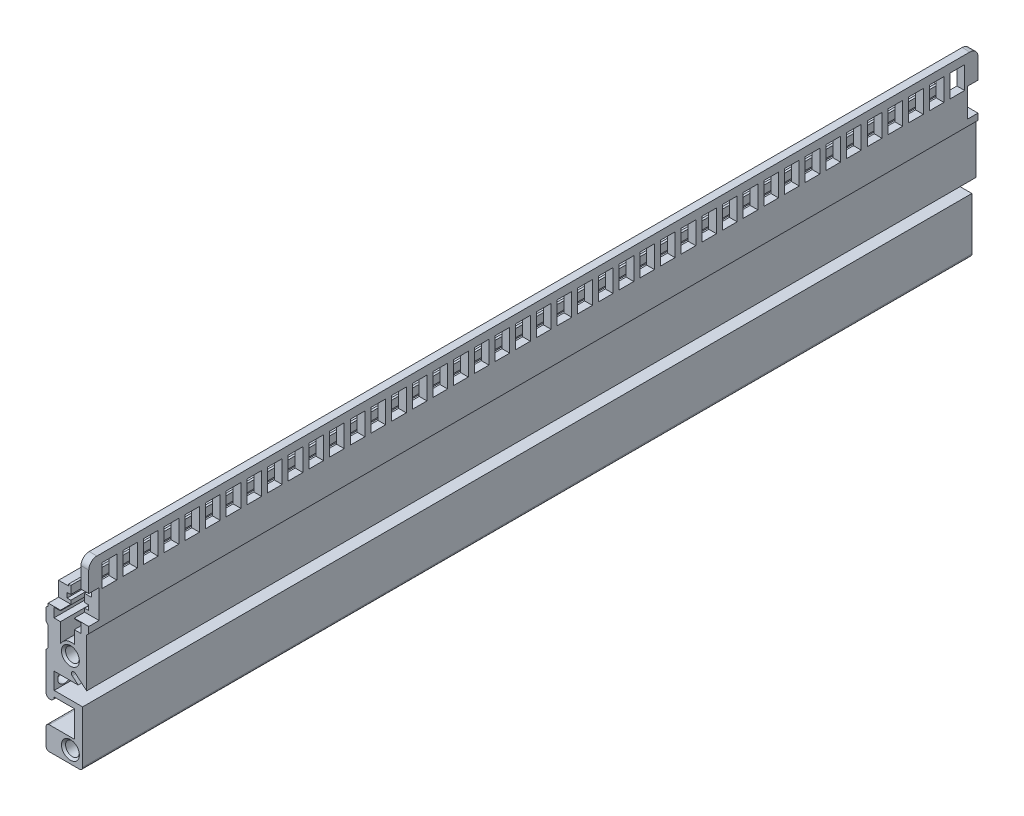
from build123d import *

# Parameters (mm, degrees)
SKETCH_1_R          = 1.7
EXTRUDE_1_DEPTH     = 218.44
FILLET_1_R          = 2
SKETCH_2_W          = 3.6
SKETCH_2_H          = 5.5
CUT_EXTRUDE_1_DEPTH = 1.9
SKETCH_3_W          = 2.54
SKETCH_3_H          = 7
CUT_EXTRUDE_2_DEPTH = 220.898348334
SKETCH_4_R          = 1.65
CUT_EXTRUDE_3_DEPTH = 2
CHAMFER_1_SIZE      = 0.5
CHAMFER_2_SIZE      = 0.5


with BuildPart() as part:
    # Sketch 1 → Extrude 1 (new body)
    with BuildSketch(Plane.XY):
        with BuildLine():
            Line((2.6, 12.5), (2.6, 22.5))
            Line((2.6, 22.5), (4.5, 22.5))
            Line((4.5, 22.5), (4.5, 6.95))
            Line((4.5, 6.95), (4, 6.45))
            Line((4, 6.45), (4, -5.445811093))
            Line((4, -5.445811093), (1.222426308, -3.115150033))
            ThreePointArc((1.222426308, -3.115150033), (0.377127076, -3.189104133), (0.451081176, -4.034403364))
            Line((0.451081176, -4.034403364), (1.899772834, -5.25))
            Line((1.899772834, -5.25), (-4, -5.25))
            Line((-4, -5.25), (-4, -9.35))
            Line((-4, -9.35), (3, -9.35))
            Line((3, -9.35), (3, -22.2))
            ThreePointArc((3, -22.2), (2.765685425, -22.765685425), (2.2, -23))
            Line((2.2, -23), (-5.2, -23))
            ThreePointArc((-5.2, -23), (-5.765685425, -22.765685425), (-6, -22.2))
            Line((-6, -22.2), (-6, -18.05))
            ThreePointArc((-6, -18.05), (-5.765685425, -17.484314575), (-5.2, -17.25))
            Line((-5.2, -17.25), (1, -17.25))
            Line((1, -17.25), (1, -10.75))
            Line((1, -10.75), (-4, -10.75))
            ThreePointArc((-4, -10.75), (-5, -11.75), (-6, -10.75))
            Line((-6, -10.75), (-6, -1.6))
            Line((-6, -1.6), (-5.550132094, -1.100195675))
            Line((-5.550132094, -1.100195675), (-5.549867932, 3.899804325))
            Line((-5.549867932, 3.899804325), (-6, 4.4))
            Line((-6, 4.4), (-6, 7.4))
            Line((-6, 7.4), (-5.7, 7.7))
            Line((-5.7, 7.7), (-5.45, 7.7))
            Line((-5.45, 7.7), (-5.45, 12.1))
            Line((-5.45, 12.1), (-3, 12.1))
            Line((-3, 12.1), (-3, 12.5))
            Line((-3, 12.5), (-2.45, 12.5))
            Line((-2.45, 12.5), (-2.45, 10.55))
            Line((-2.45, 10.55), (-3.35, 10.55))
            Line((-3.35, 10.55), (-3.35, 9.35))
            Line((-3.35, 9.35), (-2.45, 9.35))
            Line((-2.45, 9.35), (-2.45, 8.35))
            Line((-2.45, 8.35), (-4.05, 8.35))
            Line((-4.05, 8.35), (-4.05, 6.05))
            Line((-4.05, 6.05), (-2.45, 6.05))
            Line((-2.45, 6.05), (-2.45, 1.307669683))
            ThreePointArc((-2.45, 1.307669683), (-1.033604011, 2.711523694), (0.95, 2.917190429))
            Line((0.95, 2.917190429), (0.95, 6.05))
            Line((0.95, 6.05), (2.55, 6.05))
            Line((2.55, 6.05), (2.55, 8.35))
            Line((2.55, 8.35), (0.95, 8.35))
            Line((0.95, 8.35), (0.95, 9.35))
            Line((0.95, 9.35), (1.85, 9.35))
            Line((1.85, 9.35), (1.85, 10.55))
            Line((1.85, 10.55), (0.95, 10.55))
            Line((0.95, 10.55), (0.95, 12.5))
            Line((0.95, 12.5), (2.6, 12.5))
        make_face()
        Circle(SKETCH_1_R, mode=Mode.SUBTRACT)
        with Locations((0, -20)):
            Circle(SKETCH_1_R, mode=Mode.SUBTRACT)
    extrude(amount=-EXTRUDE_1_DEPTH)

    # Fillet 1
    fillet_1_edges = [part.edges().sort_by_distance(p)[0] for p in [
        (3.55, 22.5, -218.44),
        (3.55, 22.5, 0),
    ]]
    fillet(fillet_1_edges, radius=FILLET_1_R)

    # Sketch 2 → Cut-Extrude 1 (cut)
    with BuildSketch(Plane(origin=(4.5, 0, 0), x_dir=(0, 0, -1), z_dir=(1, 0, 0))):
        with Locations((10.16, 17.7)):
            Rectangle(SKETCH_2_W, SKETCH_2_H)
        with Locations((5.08, 17.7)):
            Rectangle(SKETCH_2_W, SKETCH_2_H)
        with Locations((15.24, 17.7)):
            Rectangle(SKETCH_2_W, SKETCH_2_H)
        with Locations((20.32, 17.7)):
            Rectangle(SKETCH_2_W, SKETCH_2_H)
        with Locations((25.4, 17.7)):
            Rectangle(SKETCH_2_W, SKETCH_2_H)
        with Locations((30.48, 17.7)):
            Rectangle(SKETCH_2_W, SKETCH_2_H)
        with Locations((35.56, 17.7)):
            Rectangle(SKETCH_2_W, SKETCH_2_H)
        with Locations((40.64, 17.7)):
            Rectangle(SKETCH_2_W, SKETCH_2_H)
        with Locations((45.72, 17.7)):
            Rectangle(SKETCH_2_W, SKETCH_2_H)
        with Locations((50.8, 17.7)):
            Rectangle(SKETCH_2_W, SKETCH_2_H)
        with Locations((55.88, 17.7)):
            Rectangle(SKETCH_2_W, SKETCH_2_H)
        with Locations((60.96, 17.7)):
            Rectangle(SKETCH_2_W, SKETCH_2_H)
        with Locations((66.04, 17.7)):
            Rectangle(SKETCH_2_W, SKETCH_2_H)
        with Locations((71.12, 17.7)):
            Rectangle(SKETCH_2_W, SKETCH_2_H)
        with Locations((76.2, 17.7)):
            Rectangle(SKETCH_2_W, SKETCH_2_H)
        with Locations((81.28, 17.7)):
            Rectangle(SKETCH_2_W, SKETCH_2_H)
        with Locations((86.36, 17.7)):
            Rectangle(SKETCH_2_W, SKETCH_2_H)
        with Locations((91.44, 17.7)):
            Rectangle(SKETCH_2_W, SKETCH_2_H)
        with Locations((96.52, 17.7)):
            Rectangle(SKETCH_2_W, SKETCH_2_H)
        with Locations((101.6, 17.7)):
            Rectangle(SKETCH_2_W, SKETCH_2_H)
        with Locations((106.68, 17.7)):
            Rectangle(SKETCH_2_W, SKETCH_2_H)
        with Locations((111.76, 17.7)):
            Rectangle(SKETCH_2_W, SKETCH_2_H)
        with Locations((116.84, 17.7)):
            Rectangle(SKETCH_2_W, SKETCH_2_H)
        with Locations((121.92, 17.7)):
            Rectangle(SKETCH_2_W, SKETCH_2_H)
        with Locations((127, 17.7)):
            Rectangle(SKETCH_2_W, SKETCH_2_H)
        with Locations((132.08, 17.7)):
            Rectangle(SKETCH_2_W, SKETCH_2_H)
        with Locations((137.16, 17.7)):
            Rectangle(SKETCH_2_W, SKETCH_2_H)
        with Locations((142.24, 17.7)):
            Rectangle(SKETCH_2_W, SKETCH_2_H)
        with Locations((147.32, 17.7)):
            Rectangle(SKETCH_2_W, SKETCH_2_H)
        with Locations((152.4, 17.7)):
            Rectangle(SKETCH_2_W, SKETCH_2_H)
        with Locations((157.48, 17.7)):
            Rectangle(SKETCH_2_W, SKETCH_2_H)
        with Locations((162.56, 17.7)):
            Rectangle(SKETCH_2_W, SKETCH_2_H)
        with Locations((167.64, 17.7)):
            Rectangle(SKETCH_2_W, SKETCH_2_H)
        with Locations((172.72, 17.7)):
            Rectangle(SKETCH_2_W, SKETCH_2_H)
        with Locations((177.8, 17.7)):
            Rectangle(SKETCH_2_W, SKETCH_2_H)
        with Locations((182.88, 17.7)):
            Rectangle(SKETCH_2_W, SKETCH_2_H)
        with Locations((187.96, 17.7)):
            Rectangle(SKETCH_2_W, SKETCH_2_H)
        with Locations((193.04, 17.7)):
            Rectangle(SKETCH_2_W, SKETCH_2_H)
        with Locations((198.12, 17.7)):
            Rectangle(SKETCH_2_W, SKETCH_2_H)
        with Locations((203.2, 17.7)):
            Rectangle(SKETCH_2_W, SKETCH_2_H)
        with Locations((208.28, 17.7)):
            Rectangle(SKETCH_2_W, SKETCH_2_H)
        with Locations((213.36, 17.7)):
            Rectangle(SKETCH_2_W, SKETCH_2_H)
    extrude(amount=-CUT_EXTRUDE_1_DEPTH, mode=Mode.SUBTRACT)

    # Sketch 3 → Cut-Extrude 2 (cut, through all)
    with BuildSketch(Plane(origin=(4.5, 0, 0), x_dir=(0, 0, -1), z_dir=(1, 0, 0))):
        with Locations((1.27, 12)):
            Rectangle(SKETCH_3_W, SKETCH_3_H)
    cut_extrude_2 = extrude(amount=-CUT_EXTRUDE_2_DEPTH, mode=Mode.SUBTRACT)

    # Mirror 1: Cut-Extrude 2 across plane
    add(cut_extrude_2.mirror(Plane.XY.offset(-109.22)), mode=Mode.SUBTRACT)

    # Sketch 4 → Cut-Extrude 3 (cut)
    with BuildSketch(Plane.ZY.offset(6)):
        with Locations((-215.9, -7.45)):
            Circle(SKETCH_4_R)
        with Locations((-210.82, -7.45)):
            Circle(SKETCH_4_R)
        with Locations((-205.74, -7.45)):
            Circle(SKETCH_4_R)
        with Locations((-200.66, -7.45)):
            Circle(SKETCH_4_R)
        with Locations((-195.58, -7.45)):
            Circle(SKETCH_4_R)
        with Locations((-190.5, -7.45)):
            Circle(SKETCH_4_R)
        with Locations((-185.42, -7.45)):
            Circle(SKETCH_4_R)
        with Locations((-180.34, -7.45)):
            Circle(SKETCH_4_R)
        with Locations((-175.26, -7.45)):
            Circle(SKETCH_4_R)
        with Locations((-170.18, -7.45)):
            Circle(SKETCH_4_R)
        with Locations((-165.1, -7.45)):
            Circle(SKETCH_4_R)
        with Locations((-160.02, -7.45)):
            Circle(SKETCH_4_R)
        with Locations((-154.94, -7.45)):
            Circle(SKETCH_4_R)
        with Locations((-149.86, -7.45)):
            Circle(SKETCH_4_R)
        with Locations((-144.78, -7.45)):
            Circle(SKETCH_4_R)
        with Locations((-139.7, -7.45)):
            Circle(SKETCH_4_R)
        with Locations((-134.62, -7.45)):
            Circle(SKETCH_4_R)
        with Locations((-129.54, -7.45)):
            Circle(SKETCH_4_R)
        with Locations((-124.46, -7.45)):
            Circle(SKETCH_4_R)
        with Locations((-119.38, -7.45)):
            Circle(SKETCH_4_R)
        with Locations((-114.3, -7.45)):
            Circle(SKETCH_4_R)
        with Locations((-109.22, -7.45)):
            Circle(SKETCH_4_R)
        with Locations((-104.14, -7.45)):
            Circle(SKETCH_4_R)
        with Locations((-99.06, -7.45)):
            Circle(SKETCH_4_R)
        with Locations((-93.98, -7.45)):
            Circle(SKETCH_4_R)
        with Locations((-88.9, -7.45)):
            Circle(SKETCH_4_R)
        with Locations((-83.82, -7.45)):
            Circle(SKETCH_4_R)
        with Locations((-78.74, -7.45)):
            Circle(SKETCH_4_R)
        with Locations((-73.66, -7.45)):
            Circle(SKETCH_4_R)
        with Locations((-68.58, -7.45)):
            Circle(SKETCH_4_R)
        with Locations((-63.5, -7.45)):
            Circle(SKETCH_4_R)
        with Locations((-58.42, -7.45)):
            Circle(SKETCH_4_R)
        with Locations((-53.34, -7.45)):
            Circle(SKETCH_4_R)
        with Locations((-48.26, -7.45)):
            Circle(SKETCH_4_R)
        with Locations((-43.18, -7.45)):
            Circle(SKETCH_4_R)
        with Locations((-38.1, -7.45)):
            Circle(SKETCH_4_R)
        with Locations((-33.02, -7.45)):
            Circle(SKETCH_4_R)
        with Locations((-27.94, -7.45)):
            Circle(SKETCH_4_R)
        with Locations((-22.86, -7.45)):
            Circle(SKETCH_4_R)
        with Locations((-17.78, -7.45)):
            Circle(SKETCH_4_R)
        with Locations((-12.7, -7.45)):
            Circle(SKETCH_4_R)
        with Locations((-7.62, -7.45)):
            Circle(SKETCH_4_R)
        with Locations((-2.54, -7.45)):
            Circle(SKETCH_4_R)
    extrude(amount=-CUT_EXTRUDE_3_DEPTH, mode=Mode.SUBTRACT)

    # Chamfer 1
    chamfer_1_edges = [part.edges().sort_by_distance(p)[0] for p in [
        (-1.7, 0, -218.44),
        (-1.7, 0, 0),
        (-1.7, -20, 0),
    ]]
    chamfer(chamfer_1_edges, length=CHAMFER_1_SIZE)

    # Chamfer 2
    chamfer_2_edges = [part.edges().sort_by_distance(p)[0] for p in [
        (-1.7, -20, -218.44),
    ]]
    chamfer(chamfer_2_edges, length=CHAMFER_2_SIZE)


solid = part.part
